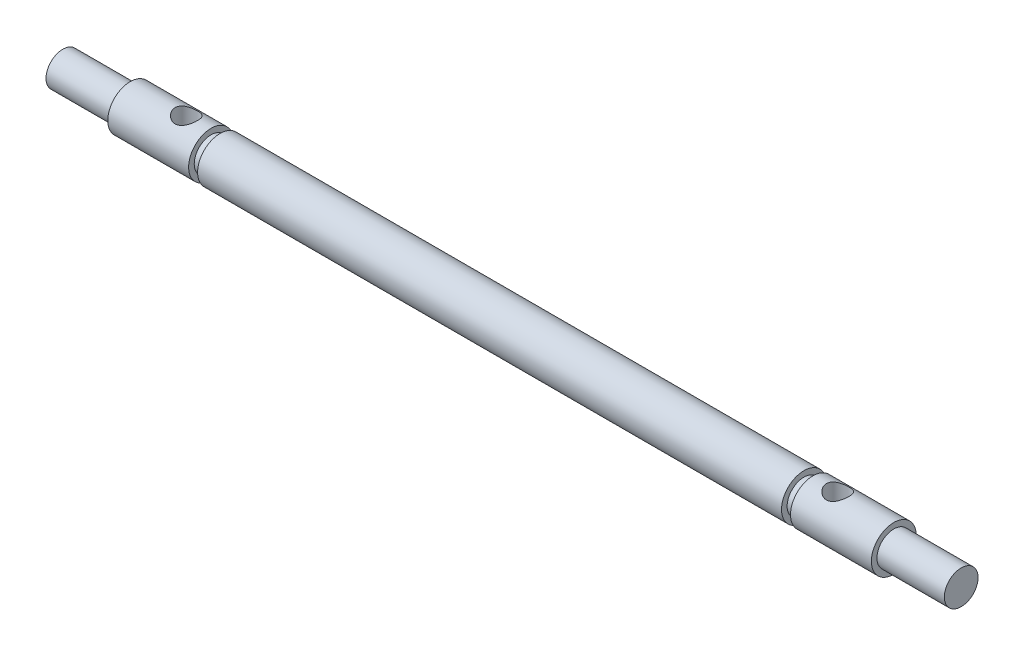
ISO-10303-21;
HEADER;
FILE_DESCRIPTION(('STEP AP214'),'2;1');
FILE_NAME('part.step','',(''),(''),'','','');
FILE_SCHEMA(('AUTOMOTIVE_DESIGN { 1 0 10303 214 1 1 1 1 }'));
ENDSEC;
DATA;
#1=APPLICATION_CONTEXT('core data for automotive mechanical design processes');
#2=APPLICATION_PROTOCOL_DEFINITION('international standard','automotive_design',2000,#1);
#3=PRODUCT_CONTEXT('',#1,'mechanical');
#4=PRODUCT('Part','Part','',(#3));
#5=PRODUCT_RELATED_PRODUCT_CATEGORY('part','',(#4));
#6=PRODUCT_DEFINITION_FORMATION('','',#4);
#7=PRODUCT_DEFINITION_CONTEXT('part definition',#1,'design');
#8=PRODUCT_DEFINITION('design','',#6,#7);
#9=PRODUCT_DEFINITION_SHAPE('','',#8);
#10=(LENGTH_UNIT() NAMED_UNIT(*) SI_UNIT(.MILLI.,.METRE.));
#11=(NAMED_UNIT(*) PLANE_ANGLE_UNIT() SI_UNIT($,.RADIAN.));
#12=(NAMED_UNIT(*) SI_UNIT($,.STERADIAN.) SOLID_ANGLE_UNIT());
#13=UNCERTAINTY_MEASURE_WITH_UNIT(LENGTH_MEASURE(1.E-05),#10,'distance_accuracy_value','');
#14=(GEOMETRIC_REPRESENTATION_CONTEXT(3) GLOBAL_UNCERTAINTY_ASSIGNED_CONTEXT((#13)) GLOBAL_UNIT_ASSIGNED_CONTEXT((#10,
#11,#12)) REPRESENTATION_CONTEXT('',''));
#15=CARTESIAN_POINT('',(0.,0.,0.));
#16=DIRECTION('',(0.,0.,1.));
#17=DIRECTION('',(1.,0.,0.));
#18=AXIS2_PLACEMENT_3D('',#15,#16,#17);
#19=CARTESIAN_POINT('',(0.,0.,0.));
#20=DIRECTION('',(1.,0.,0.));
#21=DIRECTION('',(0.,0.,1.));
#22=AXIS2_PLACEMENT_3D('',#19,#20,#21);
#23=CYLINDRICAL_SURFACE('',#22,2.);
#24=CARTESIAN_POINT('',(-26.8,0.,0.));
#25=DIRECTION('',(-1.,0.,0.));
#26=DIRECTION('',(0.,0.,1.));
#27=AXIS2_PLACEMENT_3D('',#24,#25,#26);
#28=CIRCLE('',#27,2.);
#29=CARTESIAN_POINT('',(-26.8,0.,2.));
#30=VERTEX_POINT('',#29);
#31=EDGE_CURVE('E93',#30,#30,#28,.T.);
#32=ORIENTED_EDGE('',*,*,#31,.T.);
#33=EDGE_LOOP('',(#32));
#34=FACE_BOUND('',#33,.T.);
#35=CARTESIAN_POINT('',(-34.,0.,0.));
#36=DIRECTION('',(-1.,0.,0.));
#37=DIRECTION('',(0.,0.,1.));
#38=AXIS2_PLACEMENT_3D('',#35,#36,#37);
#39=CIRCLE('',#38,2.);
#40=CARTESIAN_POINT('',(-34.,0.,2.));
#41=VERTEX_POINT('',#40);
#42=EDGE_CURVE('E97',#41,#41,#39,.T.);
#43=ORIENTED_EDGE('',*,*,#42,.F.);
#44=EDGE_LOOP('',(#43));
#45=FACE_BOUND('',#44,.T.);
#46=CARTESIAN_POINT('',(-29.,1.73205080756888,0.999999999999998));
#47=CARTESIAN_POINT('',(-28.9478921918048,1.73205534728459,0.999996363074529));
#48=CARTESIAN_POINT('',(-28.895718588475,1.73443801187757,0.995899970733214));
#49=CARTESIAN_POINT('',(-28.7929727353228,1.74362366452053,0.979723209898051));
#50=CARTESIAN_POINT('',(-28.7424040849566,1.7504359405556,0.967626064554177));
#51=CARTESIAN_POINT('',(-28.6445483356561,1.76749346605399,0.93609994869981));
#52=CARTESIAN_POINT('',(-28.5972453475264,1.77772043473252,0.916709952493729));
#53=CARTESIAN_POINT('',(-28.5065757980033,1.80042664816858,0.87126752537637));
#54=CARTESIAN_POINT('',(-28.4632094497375,1.81290601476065,0.845214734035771));
#55=CARTESIAN_POINT('',(-28.3776942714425,1.83996869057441,0.784666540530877));
#56=CARTESIAN_POINT('',(-28.3359408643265,1.85464063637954,0.749652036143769));
#57=CARTESIAN_POINT('',(-28.2585916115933,1.88371982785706,0.673253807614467));
#58=CARTESIAN_POINT('',(-28.2229988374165,1.8981269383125,0.631866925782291));
#59=CARTESIAN_POINT('',(-28.1566328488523,1.92621476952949,0.540489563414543));
#60=CARTESIAN_POINT('',(-28.1263462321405,1.93978106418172,0.490107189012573));
#61=CARTESIAN_POINT('',(-28.0748591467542,1.96350756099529,0.384157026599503));
#62=CARTESIAN_POINT('',(-28.0536529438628,1.97366991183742,0.328592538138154));
#63=CARTESIAN_POINT('',(-28.0224953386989,1.98880461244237,0.218044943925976));
#64=CARTESIAN_POINT('',(-28.0118504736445,1.99409480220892,0.163301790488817));
#65=CARTESIAN_POINT('',(-27.999833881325,2.00007583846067,0.0525706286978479));
#66=CARTESIAN_POINT('',(-27.9984565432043,2.0007694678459,-0.00341660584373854));
#67=CARTESIAN_POINT('',(-28.0047466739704,1.9976298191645,-0.10983252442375));
#68=CARTESIAN_POINT('',(-28.0116380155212,1.9941849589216,-0.160321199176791));
#69=CARTESIAN_POINT('',(-28.0328808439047,1.98374245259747,-0.259313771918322));
#70=CARTESIAN_POINT('',(-28.0472328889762,1.97674454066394,-0.307817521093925));
#71=CARTESIAN_POINT('',(-28.0830825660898,1.95971583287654,-0.402309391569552));
#72=CARTESIAN_POINT('',(-28.1046763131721,1.94964441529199,-0.448253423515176));
#73=CARTESIAN_POINT('',(-28.1542634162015,1.92737645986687,-0.535976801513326));
#74=CARTESIAN_POINT('',(-28.1822590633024,1.91517916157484,-0.577754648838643));
#75=CARTESIAN_POINT('',(-28.246895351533,1.88844394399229,-0.660173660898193));
#76=CARTESIAN_POINT('',(-28.284103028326,1.87379375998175,-0.700334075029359));
#77=CARTESIAN_POINT('',(-28.3645897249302,1.84454340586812,-0.774104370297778));
#78=CARTESIAN_POINT('',(-28.4078733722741,1.82994328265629,-0.807709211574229));
#79=CARTESIAN_POINT('',(-28.5026481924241,1.80144156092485,-0.86950533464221));
#80=CARTESIAN_POINT('',(-28.5544860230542,1.78764319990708,-0.89721731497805));
#81=CARTESIAN_POINT('',(-28.662937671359,1.76375450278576,-0.94331911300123));
#82=CARTESIAN_POINT('',(-28.7195464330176,1.75366030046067,-0.961718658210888));
#83=CARTESIAN_POINT('',(-28.8312145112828,1.73944635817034,-0.987180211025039));
#84=CARTESIAN_POINT('',(-28.8860411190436,1.73491655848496,-0.995025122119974));
#85=CARTESIAN_POINT('',(-28.9964013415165,1.7311791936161,-1.00151694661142));
#86=CARTESIAN_POINT('',(-29.0519344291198,1.73196786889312,-1.00017035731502));
#87=CARTESIAN_POINT('',(-29.1556539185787,1.73834336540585,-0.989036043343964));
#88=CARTESIAN_POINT('',(-29.2039794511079,1.74339587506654,-0.980187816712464));
#89=CARTESIAN_POINT('',(-29.298367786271,1.75694021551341,-0.955696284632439));
#90=CARTESIAN_POINT('',(-29.3444298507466,1.76543316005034,-0.940050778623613));
#91=CARTESIAN_POINT('',(-29.4354113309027,1.78536222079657,-0.901647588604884));
#92=CARTESIAN_POINT('',(-29.4801790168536,1.79691643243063,-0.87859406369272));
#93=CARTESIAN_POINT('',(-29.565469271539,1.8215611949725,-0.826287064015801));
#94=CARTESIAN_POINT('',(-29.6059896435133,1.83465253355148,-0.797030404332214));
#95=CARTESIAN_POINT('',(-29.6869787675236,1.86287998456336,-0.728837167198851));
#96=CARTESIAN_POINT('',(-29.7267971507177,1.87806583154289,-0.689145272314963));
#97=CARTESIAN_POINT('',(-29.7994122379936,1.90734234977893,-0.603404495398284));
#98=CARTESIAN_POINT('',(-29.8322065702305,1.92143265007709,-0.557353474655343));
#99=CARTESIAN_POINT('',(-29.8905737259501,1.94741361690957,-0.458535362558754));
#100=CARTESIAN_POINT('',(-29.9159331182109,1.95923641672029,-0.40562309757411));
#101=CARTESIAN_POINT('',(-29.9571379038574,1.97883354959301,-0.29552236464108));
#102=CARTESIAN_POINT('',(-29.9729916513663,1.98661143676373,-0.238337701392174));
#103=CARTESIAN_POINT('',(-29.9933685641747,1.99667508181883,-0.126979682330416));
#104=CARTESIAN_POINT('',(-29.9987978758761,1.99939927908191,-0.0730114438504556));
#105=CARTESIAN_POINT('',(-30.0008432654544,2.00042130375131,0.0351259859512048));
#106=CARTESIAN_POINT('',(-29.9974624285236,1.9987206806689,0.0892951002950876));
#107=CARTESIAN_POINT('',(-29.9825835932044,1.99133968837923,0.192537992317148));
#108=CARTESIAN_POINT('',(-29.9716351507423,1.9859289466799,0.241712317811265));
#109=CARTESIAN_POINT('',(-29.942673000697,1.97192093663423,0.337445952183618));
#110=CARTESIAN_POINT('',(-29.9246582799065,1.96332321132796,0.384004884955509));
#111=CARTESIAN_POINT('',(-29.881272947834,1.9432593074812,0.475423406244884));
#112=CARTESIAN_POINT('',(-29.8556206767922,1.93168617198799,0.520125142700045));
#113=CARTESIAN_POINT('',(-29.798042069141,1.90688133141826,0.604774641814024));
#114=CARTESIAN_POINT('',(-29.7661128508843,1.89364886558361,0.644720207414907));
#115=CARTESIAN_POINT('',(-29.6932028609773,1.86528610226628,0.72291400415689));
#116=CARTESIAN_POINT('',(-29.6516375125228,1.85009799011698,0.760597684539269));
#117=CARTESIAN_POINT('',(-29.5625492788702,1.82063076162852,0.828663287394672));
#118=CARTESIAN_POINT('',(-29.5150211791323,1.80635245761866,0.859038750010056));
#119=CARTESIAN_POINT('',(-29.413363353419,1.77999605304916,0.912431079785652));
#120=CARTESIAN_POINT('',(-29.3590724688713,1.7680017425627,0.935185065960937));
#121=CARTESIAN_POINT('',(-29.2466675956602,1.74866156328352,0.970878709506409));
#122=CARTESIAN_POINT('',(-29.1885671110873,1.74130016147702,0.983851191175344));
#123=CARTESIAN_POINT('',(-29.108194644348,1.73529272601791,0.994367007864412));
#124=CARTESIAN_POINT('',(-29.0866321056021,1.73408129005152,0.996476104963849));
#125=CARTESIAN_POINT('',(-29.0433835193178,1.7324593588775,0.999293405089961));
#126=CARTESIAN_POINT('',(-29.0216974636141,1.73204891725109,1.00000151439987));
#127=CARTESIAN_POINT('',(-29.,1.73205080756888,0.999999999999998));
#128=B_SPLINE_CURVE_WITH_KNOTS('',3,(#46,#47,#48,#49,#50,#51,#52,#53,#54,#55,#56,#57,#58,#59,
#60,#61,#62,#63,#64,#65,#66,#67,#68,#69,#70,#71,#72,#73,#74,#75,#76,#77,#78,#79,#80,#81,#82,#83,
#84,#85,#86,#87,#88,#89,#90,#91,#92,#93,#94,#95,#96,#97,#98,#99,#100,#101,#102,#103,#104,#105,
#106,#107,#108,#109,#110,#111,#112,#113,#114,#115,#116,#117,#118,#119,#120,#121,#122,#123,#124,
#125,#126,#127),.UNSPECIFIED.,.T.,.F.,(4,2,2,2,2,2,2,2,2,2,2,2,2,2,2,2,2,2,2,2,2,2,2,2,2,2,2,2,
2,2,2,2,2,2,2,2,2,2,2,2,4),(0.,0.156232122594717,0.312792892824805,0.468528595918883,
0.624272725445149,0.79286231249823,0.96153571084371,1.14157892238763,1.32150826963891,
1.48863484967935,1.6556602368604,1.80816097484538,1.96067312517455,2.11529534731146,
2.26997299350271,2.4392719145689,2.60870048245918,2.78888841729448,2.96888774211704,
3.13462290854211,3.30024093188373,3.44774183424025,3.59529052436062,3.74967296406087,
3.90413486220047,4.07806743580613,4.25205864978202,4.43064181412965,4.60906779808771,
4.77112270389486,4.93312086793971,5.08444424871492,5.23578933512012,5.39360750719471,
5.55149830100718,5.72510241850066,5.89885942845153,6.07810749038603,6.25675133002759,
6.32180135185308,6.38685572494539),.UNSPECIFIED.);
#129=CARTESIAN_POINT('',(-29.,1.73205080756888,0.999999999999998));
#130=VERTEX_POINT('',#129);
#131=EDGE_CURVE('E40',#130,#130,#128,.T.);
#132=ORIENTED_EDGE('',*,*,#131,.F.);
#133=EDGE_LOOP('',(#132));
#134=FACE_BOUND('',#133,.T.);
#135=CARTESIAN_POINT('',(-28.,-2.,0.));
#136=CARTESIAN_POINT('',(-28.0000033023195,-1.99999713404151,0.0525719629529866));
#137=CARTESIAN_POINT('',(-28.0041700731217,-1.99790491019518,0.105206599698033));
#138=CARTESIAN_POINT('',(-28.0206528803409,-1.98974156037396,0.208920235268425));
#139=CARTESIAN_POINT('',(-28.0329843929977,-1.98366287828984,0.259996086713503));
#140=CARTESIAN_POINT('',(-28.0651938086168,-1.96816279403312,0.358933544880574));
#141=CARTESIAN_POINT('',(-28.085042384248,-1.9587543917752,0.406806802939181));
#142=CARTESIAN_POINT('',(-28.1315706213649,-1.93745776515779,0.498472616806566));
#143=CARTESIAN_POINT('',(-28.1582497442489,-1.9255697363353,0.542265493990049));
#144=CARTESIAN_POINT('',(-28.2195172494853,-1.89956258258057,0.627507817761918));
#145=CARTESIAN_POINT('',(-28.2544864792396,-1.88535199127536,0.668655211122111));
#146=CARTESIAN_POINT('',(-28.330521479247,-1.85659970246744,0.744779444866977));
#147=CARTESIAN_POINT('',(-28.3715918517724,-1.84205776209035,0.779751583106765));
#148=CARTESIAN_POINT('',(-28.4624833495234,-1.81298951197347,0.845252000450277));
#149=CARTESIAN_POINT('',(-28.5127360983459,-1.79855186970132,0.875225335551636));
#150=CARTESIAN_POINT('',(-28.6183673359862,-1.77285978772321,0.926168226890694));
#151=CARTESIAN_POINT('',(-28.6737421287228,-1.7616030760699,0.947144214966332));
#152=CARTESIAN_POINT('',(-28.7846651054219,-1.74457867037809,0.978132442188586));
#153=CARTESIAN_POINT('',(-28.8400044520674,-1.73852271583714,0.988725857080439));
#154=CARTESIAN_POINT('',(-28.9519788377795,-1.73181889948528,1.00042699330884));
#155=CARTESIAN_POINT('',(-29.0086125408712,-1.73116569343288,1.00154408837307));
#156=CARTESIAN_POINT('',(-29.1142860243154,-1.73510930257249,0.994687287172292));
#157=CARTESIAN_POINT('',(-29.163424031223,-1.73908763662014,0.98778455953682));
#158=CARTESIAN_POINT('',(-29.259721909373,-1.7507622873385,0.966939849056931));
#159=CARTESIAN_POINT('',(-29.3068811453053,-1.75845978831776,0.95299562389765));
#160=CARTESIAN_POINT('',(-29.3992291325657,-1.77687476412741,0.918209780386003));
#161=CARTESIAN_POINT('',(-29.4443463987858,-1.78765840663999,0.897215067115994));
#162=CARTESIAN_POINT('',(-29.53063429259,-1.81103404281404,0.849041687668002));
#163=CARTESIAN_POINT('',(-29.5718031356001,-1.82362684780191,0.821860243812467));
#164=CARTESIAN_POINT('',(-29.6545212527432,-1.85113157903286,0.758066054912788));
#165=CARTESIAN_POINT('',(-29.6954568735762,-1.86613510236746,0.720694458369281));
#166=CARTESIAN_POINT('',(-29.7707354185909,-1.89547623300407,0.639555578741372));
#167=CARTESIAN_POINT('',(-29.8050751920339,-1.90981351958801,0.595785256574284));
#168=CARTESIAN_POINT('',(-29.8676856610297,-1.93701987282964,0.500516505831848));
#169=CARTESIAN_POINT('',(-29.8956004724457,-1.94978984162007,0.448753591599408));
#170=CARTESIAN_POINT('',(-29.942097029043,-1.97157881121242,0.340466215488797));
#171=CARTESIAN_POINT('',(-29.9606861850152,-1.98060078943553,0.283945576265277));
#172=CARTESIAN_POINT('',(-29.9864754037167,-1.99324333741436,0.172766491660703));
#173=CARTESIAN_POINT('',(-29.9944912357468,-1.99724938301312,0.118341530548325));
#174=CARTESIAN_POINT('',(-30.0014647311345,-2.00073013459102,0.0087795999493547));
#175=CARTESIAN_POINT('',(-30.0004266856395,-2.00020698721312,-0.0463570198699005));
#176=CARTESIAN_POINT('',(-29.9897933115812,-1.99491192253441,-0.151232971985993));
#177=CARTESIAN_POINT('',(-29.98086746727,-1.9904724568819,-0.201059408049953));
#178=CARTESIAN_POINT('',(-29.9557619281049,-1.97822171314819,-0.298406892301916));
#179=CARTESIAN_POINT('',(-29.9395814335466,-1.97041006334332,-0.345927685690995));
#180=CARTESIAN_POINT('',(-29.9000015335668,-1.95184251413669,-0.438888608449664));
#181=CARTESIAN_POINT('',(-29.8764089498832,-1.94100881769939,-0.484230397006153));
#182=CARTESIAN_POINT('',(-29.822892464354,-1.91743974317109,-0.57046136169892));
#183=CARTESIAN_POINT('',(-29.7929658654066,-1.90470355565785,-0.61134862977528));
#184=CARTESIAN_POINT('',(-29.7242395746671,-1.87708221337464,-0.691767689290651));
#185=CARTESIAN_POINT('',(-29.6848571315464,-1.86210884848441,-0.730772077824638));
#186=CARTESIAN_POINT('',(-29.6000748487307,-1.83262391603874,-0.801856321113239));
#187=CARTESIAN_POINT('',(-29.5546708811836,-1.81811267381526,-0.83393138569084));
#188=CARTESIAN_POINT('',(-29.4563563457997,-1.79051192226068,-0.891707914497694));
#189=CARTESIAN_POINT('',(-29.4031887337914,-1.77752529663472,-0.917025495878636));
#190=CARTESIAN_POINT('',(-29.2924899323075,-1.75574072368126,-0.958082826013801));
#191=CARTESIAN_POINT('',(-29.2349644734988,-1.74693738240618,-0.973834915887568));
#192=CARTESIAN_POINT('',(-29.1230897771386,-1.73561501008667,-0.993861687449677));
#193=CARTESIAN_POINT('',(-29.068965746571,-1.73257383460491,-0.999092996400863));
#194=CARTESIAN_POINT('',(-28.9605529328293,-1.73165354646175,-1.00068915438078));
#195=CARTESIAN_POINT('',(-28.9062642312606,-1.73377219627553,-0.997057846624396));
#196=CARTESIAN_POINT('',(-28.804516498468,-1.74237862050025,-0.981926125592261));
#197=CARTESIAN_POINT('',(-28.7568995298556,-1.74843094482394,-0.971208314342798));
#198=CARTESIAN_POINT('',(-28.6641918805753,-1.76371016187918,-0.943175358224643));
#199=CARTESIAN_POINT('',(-28.619102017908,-1.77293807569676,-0.925858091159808));
#200=CARTESIAN_POINT('',(-28.5293751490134,-1.79428530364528,-0.88381574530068));
#201=CARTESIAN_POINT('',(-28.4849720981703,-1.80655722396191,-0.858671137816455));
#202=CARTESIAN_POINT('',(-28.4007254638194,-1.8323533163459,-0.802150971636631));
#203=CARTESIAN_POINT('',(-28.3608842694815,-1.84587813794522,-0.770772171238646));
#204=CARTESIAN_POINT('',(-28.2818580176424,-1.87462323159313,-0.69820332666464));
#205=CARTESIAN_POINT('',(-28.2433408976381,-1.88984983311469,-0.65628442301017));
#206=CARTESIAN_POINT('',(-28.1737370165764,-1.91877752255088,-0.566154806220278));
#207=CARTESIAN_POINT('',(-28.1426542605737,-1.9324777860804,-0.517940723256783));
#208=CARTESIAN_POINT('',(-28.0887636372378,-1.95698009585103,-0.415931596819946));
#209=CARTESIAN_POINT('',(-28.0660158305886,-1.96776096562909,-0.362099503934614));
#210=CARTESIAN_POINT('',(-28.030191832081,-1.98501341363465,-0.250742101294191));
#211=CARTESIAN_POINT('',(-28.0170881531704,-1.99149723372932,-0.193227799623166));
#212=CARTESIAN_POINT('',(-28.0061025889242,-1.99695461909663,-0.112601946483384));
#213=CARTESIAN_POINT('',(-28.0038173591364,-1.99809365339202,-0.0901618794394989));
#214=CARTESIAN_POINT('',(-28.0007653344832,-1.99961696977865,-0.0451517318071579));
#215=CARTESIAN_POINT('',(-27.9999985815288,-2.00000123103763,-0.0225816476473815));
#216=CARTESIAN_POINT('',(-28.,-2.,0.));
#217=B_SPLINE_CURVE_WITH_KNOTS('',3,(#135,#136,#137,#138,#139,#140,#141,#142,#143,#144,#145,
#146,#147,#148,#149,#150,#151,#152,#153,#154,#155,#156,#157,#158,#159,#160,#161,#162,#163,#164,
#165,#166,#167,#168,#169,#170,#171,#172,#173,#174,#175,#176,#177,#178,#179,#180,#181,#182,#183,
#184,#185,#186,#187,#188,#189,#190,#191,#192,#193,#194,#195,#196,#197,#198,#199,#200,#201,#202,
#203,#204,#205,#206,#207,#208,#209,#210,#211,#212,#213,#214,#215,#216),.UNSPECIFIED.,.T.,.F.,(4,
2,2,2,2,2,2,2,2,2,2,2,2,2,2,2,2,2,2,2,2,2,2,2,2,2,2,2,2,2,2,2,2,2,2,2,2,2,2,2,4),(0.,
0.157624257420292,0.315548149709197,0.472862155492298,0.630163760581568,0.796981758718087,
0.963926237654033,1.14381726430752,1.32357947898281,1.49258012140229,1.6614135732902,
1.8100571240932,1.95874803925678,2.11090240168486,2.26312521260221,2.43464941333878,
2.60625534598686,2.7858302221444,2.96526216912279,3.12983290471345,3.29432564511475,
3.44606906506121,3.59782921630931,3.75392856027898,3.91009450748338,4.08159610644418,
4.25321588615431,4.43314682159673,4.61284511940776,4.77529307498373,4.93767059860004,
5.08457930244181,5.23153528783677,5.38836456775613,5.54527561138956,5.72125242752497,
5.89732383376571,6.07464013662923,6.25144908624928,6.31915280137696,6.38685838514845),.UNSPECIFIED.);
#218=CARTESIAN_POINT('',(-28.,-2.,0.));
#219=VERTEX_POINT('',#218);
#220=EDGE_CURVE('E10',#219,#219,#217,.T.);
#221=ORIENTED_EDGE('',*,*,#220,.F.);
#222=EDGE_LOOP('',(#221));
#223=FACE_BOUND('',#222,.T.);
#224=ADVANCED_FACE('F29',(#34,#45,#134,#223),#23,.T.);
#225=CARTESIAN_POINT('',(40.,0.,-1.5));
#226=DIRECTION('',(-1.,0.,0.));
#227=DIRECTION('',(0.,0.,1.));
#228=AXIS2_PLACEMENT_3D('',#225,#226,#227);
#229=PLANE('',#228);
#230=CARTESIAN_POINT('',(40.,0.,0.));
#231=DIRECTION('',(-1.,0.,0.));
#232=DIRECTION('',(0.,0.,1.));
#233=AXIS2_PLACEMENT_3D('',#230,#231,#232);
#234=CIRCLE('',#233,1.5);
#235=CARTESIAN_POINT('',(40.,0.,1.5));
#236=VERTEX_POINT('',#235);
#237=EDGE_CURVE('E128',#236,#236,#234,.T.);
#238=ORIENTED_EDGE('',*,*,#237,.F.);
#239=EDGE_LOOP('',(#238));
#240=FACE_BOUND('',#239,.T.);
#241=ADVANCED_FACE('F31',(#240),#229,.F.);
#242=CARTESIAN_POINT('',(0.,0.,0.));
#243=DIRECTION('',(-1.,0.,0.));
#244=DIRECTION('',(0.,0.,1.));
#245=AXIS2_PLACEMENT_3D('',#242,#243,#244);
#246=CYLINDRICAL_SURFACE('',#245,1.5);
#247=CARTESIAN_POINT('',(34.,0.,0.));
#248=DIRECTION('',(-1.,0.,0.));
#249=DIRECTION('',(0.,0.,1.));
#250=AXIS2_PLACEMENT_3D('',#247,#248,#249);
#251=CIRCLE('',#250,1.5);
#252=CARTESIAN_POINT('',(34.,0.,1.5));
#253=VERTEX_POINT('',#252);
#254=EDGE_CURVE('E125',#253,#253,#251,.T.);
#255=ORIENTED_EDGE('',*,*,#254,.F.);
#256=EDGE_LOOP('',(#255));
#257=FACE_BOUND('',#256,.T.);
#258=ORIENTED_EDGE('',*,*,#237,.T.);
#259=EDGE_LOOP('',(#258));
#260=FACE_BOUND('',#259,.T.);
#261=ADVANCED_FACE('F88',(#257,#260),#246,.T.);
#262=CARTESIAN_POINT('',(34.,0.,-2.));
#263=DIRECTION('',(-1.,0.,0.));
#264=DIRECTION('',(0.,0.,1.));
#265=AXIS2_PLACEMENT_3D('',#262,#263,#264);
#266=PLANE('',#265);
#267=CARTESIAN_POINT('',(34.,0.,0.));
#268=DIRECTION('',(-1.,0.,0.));
#269=DIRECTION('',(0.,0.,1.));
#270=AXIS2_PLACEMENT_3D('',#267,#268,#269);
#271=CIRCLE('',#270,2.);
#272=CARTESIAN_POINT('',(34.,0.,2.));
#273=VERTEX_POINT('',#272);
#274=EDGE_CURVE('E122',#273,#273,#271,.T.);
#275=ORIENTED_EDGE('',*,*,#274,.F.);
#276=EDGE_LOOP('',(#275));
#277=FACE_BOUND('',#276,.T.);
#278=ORIENTED_EDGE('',*,*,#254,.T.);
#279=EDGE_LOOP('',(#278));
#280=FACE_BOUND('',#279,.T.);
#281=ADVANCED_FACE('F163',(#277,#280),#266,.F.);
#282=CARTESIAN_POINT('',(0.,0.,0.));
#283=DIRECTION('',(-1.,0.,0.));
#284=DIRECTION('',(0.,0.,1.));
#285=AXIS2_PLACEMENT_3D('',#282,#283,#284);
#286=CYLINDRICAL_SURFACE('',#285,2.);
#287=CARTESIAN_POINT('',(28.,-2.,0.));
#288=CARTESIAN_POINT('',(28.0000033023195,-1.99999713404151,0.0525719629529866));
#289=CARTESIAN_POINT('',(28.0041700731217,-1.99790491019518,0.105206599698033));
#290=CARTESIAN_POINT('',(28.0206528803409,-1.98974156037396,0.208920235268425));
#291=CARTESIAN_POINT('',(28.0329843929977,-1.98366287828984,0.259996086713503));
#292=CARTESIAN_POINT('',(28.0651938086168,-1.96816279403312,0.358933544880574));
#293=CARTESIAN_POINT('',(28.085042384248,-1.9587543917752,0.406806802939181));
#294=CARTESIAN_POINT('',(28.1315706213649,-1.93745776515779,0.498472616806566));
#295=CARTESIAN_POINT('',(28.1582497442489,-1.9255697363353,0.542265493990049));
#296=CARTESIAN_POINT('',(28.2195172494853,-1.89956258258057,0.627507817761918));
#297=CARTESIAN_POINT('',(28.2544864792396,-1.88535199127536,0.668655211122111));
#298=CARTESIAN_POINT('',(28.330521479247,-1.85659970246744,0.744779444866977));
#299=CARTESIAN_POINT('',(28.3715918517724,-1.84205776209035,0.779751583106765));
#300=CARTESIAN_POINT('',(28.4624833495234,-1.81298951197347,0.845252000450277));
#301=CARTESIAN_POINT('',(28.5127360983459,-1.79855186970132,0.875225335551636));
#302=CARTESIAN_POINT('',(28.6183673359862,-1.77285978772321,0.926168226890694));
#303=CARTESIAN_POINT('',(28.6737421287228,-1.7616030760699,0.947144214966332));
#304=CARTESIAN_POINT('',(28.7846651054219,-1.74457867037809,0.978132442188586));
#305=CARTESIAN_POINT('',(28.8400044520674,-1.73852271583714,0.988725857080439));
#306=CARTESIAN_POINT('',(28.9519788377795,-1.73181889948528,1.00042699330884));
#307=CARTESIAN_POINT('',(29.0086125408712,-1.73116569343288,1.00154408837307));
#308=CARTESIAN_POINT('',(29.1142860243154,-1.73510930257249,0.994687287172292));
#309=CARTESIAN_POINT('',(29.163424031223,-1.73908763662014,0.98778455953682));
#310=CARTESIAN_POINT('',(29.259721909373,-1.7507622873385,0.966939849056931));
#311=CARTESIAN_POINT('',(29.3068811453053,-1.75845978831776,0.95299562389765));
#312=CARTESIAN_POINT('',(29.3992291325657,-1.77687476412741,0.918209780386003));
#313=CARTESIAN_POINT('',(29.4443463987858,-1.78765840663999,0.897215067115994));
#314=CARTESIAN_POINT('',(29.53063429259,-1.81103404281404,0.849041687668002));
#315=CARTESIAN_POINT('',(29.5718031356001,-1.82362684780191,0.821860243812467));
#316=CARTESIAN_POINT('',(29.6545212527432,-1.85113157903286,0.758066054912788));
#317=CARTESIAN_POINT('',(29.6954568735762,-1.86613510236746,0.720694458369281));
#318=CARTESIAN_POINT('',(29.7707354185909,-1.89547623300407,0.639555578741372));
#319=CARTESIAN_POINT('',(29.8050751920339,-1.90981351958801,0.595785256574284));
#320=CARTESIAN_POINT('',(29.8676856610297,-1.93701987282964,0.500516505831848));
#321=CARTESIAN_POINT('',(29.8956004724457,-1.94978984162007,0.448753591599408));
#322=CARTESIAN_POINT('',(29.942097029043,-1.97157881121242,0.340466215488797));
#323=CARTESIAN_POINT('',(29.9606861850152,-1.98060078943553,0.283945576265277));
#324=CARTESIAN_POINT('',(29.9864754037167,-1.99324333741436,0.172766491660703));
#325=CARTESIAN_POINT('',(29.9944912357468,-1.99724938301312,0.118341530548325));
#326=CARTESIAN_POINT('',(30.0014647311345,-2.00073013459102,0.0087795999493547));
#327=CARTESIAN_POINT('',(30.0004266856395,-2.00020698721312,-0.0463570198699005));
#328=CARTESIAN_POINT('',(29.9897933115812,-1.99491192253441,-0.151232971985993));
#329=CARTESIAN_POINT('',(29.98086746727,-1.9904724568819,-0.201059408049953));
#330=CARTESIAN_POINT('',(29.9557619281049,-1.97822171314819,-0.298406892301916));
#331=CARTESIAN_POINT('',(29.9395814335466,-1.97041006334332,-0.345927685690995));
#332=CARTESIAN_POINT('',(29.9000015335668,-1.95184251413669,-0.438888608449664));
#333=CARTESIAN_POINT('',(29.8764089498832,-1.94100881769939,-0.484230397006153));
#334=CARTESIAN_POINT('',(29.822892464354,-1.91743974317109,-0.57046136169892));
#335=CARTESIAN_POINT('',(29.7929658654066,-1.90470355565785,-0.61134862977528));
#336=CARTESIAN_POINT('',(29.7242395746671,-1.87708221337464,-0.691767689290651));
#337=CARTESIAN_POINT('',(29.6848571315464,-1.86210884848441,-0.730772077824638));
#338=CARTESIAN_POINT('',(29.6000748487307,-1.83262391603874,-0.801856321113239));
#339=CARTESIAN_POINT('',(29.5546708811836,-1.81811267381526,-0.83393138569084));
#340=CARTESIAN_POINT('',(29.4563563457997,-1.79051192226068,-0.891707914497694));
#341=CARTESIAN_POINT('',(29.4031887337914,-1.77752529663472,-0.917025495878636));
#342=CARTESIAN_POINT('',(29.2924899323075,-1.75574072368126,-0.958082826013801));
#343=CARTESIAN_POINT('',(29.2349644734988,-1.74693738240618,-0.973834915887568));
#344=CARTESIAN_POINT('',(29.1230897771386,-1.73561501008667,-0.993861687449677));
#345=CARTESIAN_POINT('',(29.068965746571,-1.73257383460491,-0.999092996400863));
#346=CARTESIAN_POINT('',(28.9605529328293,-1.73165354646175,-1.00068915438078));
#347=CARTESIAN_POINT('',(28.9062642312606,-1.73377219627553,-0.997057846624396));
#348=CARTESIAN_POINT('',(28.804516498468,-1.74237862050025,-0.981926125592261));
#349=CARTESIAN_POINT('',(28.7568995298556,-1.74843094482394,-0.971208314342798));
#350=CARTESIAN_POINT('',(28.6641918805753,-1.76371016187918,-0.943175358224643));
#351=CARTESIAN_POINT('',(28.619102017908,-1.77293807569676,-0.925858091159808));
#352=CARTESIAN_POINT('',(28.5293751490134,-1.79428530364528,-0.88381574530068));
#353=CARTESIAN_POINT('',(28.4849720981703,-1.80655722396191,-0.858671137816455));
#354=CARTESIAN_POINT('',(28.4007254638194,-1.8323533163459,-0.802150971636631));
#355=CARTESIAN_POINT('',(28.3608842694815,-1.84587813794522,-0.770772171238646));
#356=CARTESIAN_POINT('',(28.2818580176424,-1.87462323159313,-0.69820332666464));
#357=CARTESIAN_POINT('',(28.2433408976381,-1.88984983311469,-0.65628442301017));
#358=CARTESIAN_POINT('',(28.1737370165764,-1.91877752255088,-0.566154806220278));
#359=CARTESIAN_POINT('',(28.1426542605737,-1.9324777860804,-0.517940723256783));
#360=CARTESIAN_POINT('',(28.0887636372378,-1.95698009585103,-0.415931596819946));
#361=CARTESIAN_POINT('',(28.0660158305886,-1.96776096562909,-0.362099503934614));
#362=CARTESIAN_POINT('',(28.030191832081,-1.98501341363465,-0.250742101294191));
#363=CARTESIAN_POINT('',(28.0170881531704,-1.99149723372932,-0.193227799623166));
#364=CARTESIAN_POINT('',(28.0061025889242,-1.99695461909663,-0.112601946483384));
#365=CARTESIAN_POINT('',(28.0038173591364,-1.99809365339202,-0.0901618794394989));
#366=CARTESIAN_POINT('',(28.0007653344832,-1.99961696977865,-0.0451517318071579));
#367=CARTESIAN_POINT('',(27.9999985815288,-2.00000123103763,-0.0225816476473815));
#368=CARTESIAN_POINT('',(28.,-2.,0.));
#369=B_SPLINE_CURVE_WITH_KNOTS('',3,(#287,#288,#289,#290,#291,#292,#293,#294,#295,#296,#297,
#298,#299,#300,#301,#302,#303,#304,#305,#306,#307,#308,#309,#310,#311,#312,#313,#314,#315,#316,
#317,#318,#319,#320,#321,#322,#323,#324,#325,#326,#327,#328,#329,#330,#331,#332,#333,#334,#335,
#336,#337,#338,#339,#340,#341,#342,#343,#344,#345,#346,#347,#348,#349,#350,#351,#352,#353,#354,
#355,#356,#357,#358,#359,#360,#361,#362,#363,#364,#365,#366,#367,#368),.UNSPECIFIED.,.T.,.F.,(4,
2,2,2,2,2,2,2,2,2,2,2,2,2,2,2,2,2,2,2,2,2,2,2,2,2,2,2,2,2,2,2,2,2,2,2,2,2,2,2,4),(0.,
0.157624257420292,0.315548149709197,0.472862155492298,0.630163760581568,0.796981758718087,
0.963926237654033,1.14381726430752,1.32357947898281,1.49258012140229,1.6614135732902,
1.8100571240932,1.95874803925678,2.11090240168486,2.26312521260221,2.43464941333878,
2.60625534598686,2.7858302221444,2.96526216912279,3.12983290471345,3.29432564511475,
3.44606906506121,3.59782921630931,3.75392856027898,3.91009450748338,4.08159610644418,
4.25321588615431,4.43314682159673,4.61284511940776,4.77529307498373,4.93767059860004,
5.08457930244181,5.23153528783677,5.38836456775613,5.54527561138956,5.72125242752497,
5.89732383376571,6.07464013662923,6.25144908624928,6.31915280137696,6.38685838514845),.UNSPECIFIED.);
#370=CARTESIAN_POINT('',(28.,-2.,0.));
#371=VERTEX_POINT('',#370);
#372=EDGE_CURVE('E44',#371,#371,#369,.T.);
#373=ORIENTED_EDGE('',*,*,#372,.T.);
#374=EDGE_LOOP('',(#373));
#375=FACE_BOUND('',#374,.T.);
#376=CARTESIAN_POINT('',(29.,1.73205080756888,0.999999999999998));
#377=CARTESIAN_POINT('',(28.9478921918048,1.73205534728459,0.999996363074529));
#378=CARTESIAN_POINT('',(28.895718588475,1.73443801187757,0.995899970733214));
#379=CARTESIAN_POINT('',(28.7929727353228,1.74362366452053,0.979723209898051));
#380=CARTESIAN_POINT('',(28.7424040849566,1.7504359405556,0.967626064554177));
#381=CARTESIAN_POINT('',(28.6445483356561,1.76749346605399,0.93609994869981));
#382=CARTESIAN_POINT('',(28.5972453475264,1.77772043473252,0.916709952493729));
#383=CARTESIAN_POINT('',(28.5065757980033,1.80042664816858,0.87126752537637));
#384=CARTESIAN_POINT('',(28.4632094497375,1.81290601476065,0.845214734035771));
#385=CARTESIAN_POINT('',(28.3776942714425,1.83996869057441,0.784666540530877));
#386=CARTESIAN_POINT('',(28.3359408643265,1.85464063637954,0.749652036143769));
#387=CARTESIAN_POINT('',(28.2585916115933,1.88371982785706,0.673253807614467));
#388=CARTESIAN_POINT('',(28.2229988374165,1.8981269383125,0.631866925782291));
#389=CARTESIAN_POINT('',(28.1566328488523,1.92621476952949,0.540489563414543));
#390=CARTESIAN_POINT('',(28.1263462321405,1.93978106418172,0.490107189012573));
#391=CARTESIAN_POINT('',(28.0748591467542,1.96350756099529,0.384157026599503));
#392=CARTESIAN_POINT('',(28.0536529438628,1.97366991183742,0.328592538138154));
#393=CARTESIAN_POINT('',(28.0224953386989,1.98880461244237,0.218044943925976));
#394=CARTESIAN_POINT('',(28.0118504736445,1.99409480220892,0.163301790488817));
#395=CARTESIAN_POINT('',(27.999833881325,2.00007583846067,0.0525706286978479));
#396=CARTESIAN_POINT('',(27.9984565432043,2.0007694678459,-0.00341660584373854));
#397=CARTESIAN_POINT('',(28.0047466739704,1.9976298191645,-0.10983252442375));
#398=CARTESIAN_POINT('',(28.0116380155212,1.9941849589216,-0.160321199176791));
#399=CARTESIAN_POINT('',(28.0328808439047,1.98374245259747,-0.259313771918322));
#400=CARTESIAN_POINT('',(28.0472328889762,1.97674454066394,-0.307817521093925));
#401=CARTESIAN_POINT('',(28.0830825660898,1.95971583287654,-0.402309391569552));
#402=CARTESIAN_POINT('',(28.1046763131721,1.94964441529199,-0.448253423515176));
#403=CARTESIAN_POINT('',(28.1542634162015,1.92737645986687,-0.535976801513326));
#404=CARTESIAN_POINT('',(28.1822590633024,1.91517916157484,-0.577754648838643));
#405=CARTESIAN_POINT('',(28.246895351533,1.88844394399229,-0.660173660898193));
#406=CARTESIAN_POINT('',(28.284103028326,1.87379375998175,-0.700334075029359));
#407=CARTESIAN_POINT('',(28.3645897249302,1.84454340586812,-0.774104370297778));
#408=CARTESIAN_POINT('',(28.4078733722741,1.82994328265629,-0.807709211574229));
#409=CARTESIAN_POINT('',(28.5026481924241,1.80144156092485,-0.86950533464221));
#410=CARTESIAN_POINT('',(28.5544860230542,1.78764319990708,-0.89721731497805));
#411=CARTESIAN_POINT('',(28.662937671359,1.76375450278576,-0.94331911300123));
#412=CARTESIAN_POINT('',(28.7195464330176,1.75366030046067,-0.961718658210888));
#413=CARTESIAN_POINT('',(28.8312145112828,1.73944635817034,-0.987180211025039));
#414=CARTESIAN_POINT('',(28.8860411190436,1.73491655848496,-0.995025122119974));
#415=CARTESIAN_POINT('',(28.9964013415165,1.7311791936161,-1.00151694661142));
#416=CARTESIAN_POINT('',(29.0519344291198,1.73196786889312,-1.00017035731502));
#417=CARTESIAN_POINT('',(29.1556539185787,1.73834336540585,-0.989036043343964));
#418=CARTESIAN_POINT('',(29.2039794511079,1.74339587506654,-0.980187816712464));
#419=CARTESIAN_POINT('',(29.298367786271,1.75694021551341,-0.955696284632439));
#420=CARTESIAN_POINT('',(29.3444298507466,1.76543316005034,-0.940050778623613));
#421=CARTESIAN_POINT('',(29.4354113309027,1.78536222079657,-0.901647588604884));
#422=CARTESIAN_POINT('',(29.4801790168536,1.79691643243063,-0.87859406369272));
#423=CARTESIAN_POINT('',(29.565469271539,1.8215611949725,-0.826287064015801));
#424=CARTESIAN_POINT('',(29.6059896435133,1.83465253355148,-0.797030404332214));
#425=CARTESIAN_POINT('',(29.6869787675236,1.86287998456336,-0.728837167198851));
#426=CARTESIAN_POINT('',(29.7267971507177,1.87806583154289,-0.689145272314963));
#427=CARTESIAN_POINT('',(29.7994122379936,1.90734234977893,-0.603404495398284));
#428=CARTESIAN_POINT('',(29.8322065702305,1.92143265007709,-0.557353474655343));
#429=CARTESIAN_POINT('',(29.8905737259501,1.94741361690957,-0.458535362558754));
#430=CARTESIAN_POINT('',(29.9159331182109,1.95923641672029,-0.40562309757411));
#431=CARTESIAN_POINT('',(29.9571379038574,1.97883354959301,-0.29552236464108));
#432=CARTESIAN_POINT('',(29.9729916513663,1.98661143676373,-0.238337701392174));
#433=CARTESIAN_POINT('',(29.9933685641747,1.99667508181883,-0.126979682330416));
#434=CARTESIAN_POINT('',(29.9987978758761,1.99939927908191,-0.0730114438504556));
#435=CARTESIAN_POINT('',(30.0008432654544,2.00042130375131,0.0351259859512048));
#436=CARTESIAN_POINT('',(29.9974624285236,1.9987206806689,0.0892951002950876));
#437=CARTESIAN_POINT('',(29.9825835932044,1.99133968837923,0.192537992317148));
#438=CARTESIAN_POINT('',(29.9716351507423,1.9859289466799,0.241712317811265));
#439=CARTESIAN_POINT('',(29.942673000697,1.97192093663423,0.337445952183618));
#440=CARTESIAN_POINT('',(29.9246582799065,1.96332321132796,0.384004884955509));
#441=CARTESIAN_POINT('',(29.881272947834,1.9432593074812,0.475423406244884));
#442=CARTESIAN_POINT('',(29.8556206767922,1.93168617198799,0.520125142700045));
#443=CARTESIAN_POINT('',(29.798042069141,1.90688133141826,0.604774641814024));
#444=CARTESIAN_POINT('',(29.7661128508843,1.89364886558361,0.644720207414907));
#445=CARTESIAN_POINT('',(29.6932028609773,1.86528610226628,0.72291400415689));
#446=CARTESIAN_POINT('',(29.6516375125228,1.85009799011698,0.760597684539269));
#447=CARTESIAN_POINT('',(29.5625492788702,1.82063076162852,0.828663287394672));
#448=CARTESIAN_POINT('',(29.5150211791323,1.80635245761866,0.859038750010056));
#449=CARTESIAN_POINT('',(29.413363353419,1.77999605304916,0.912431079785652));
#450=CARTESIAN_POINT('',(29.3590724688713,1.7680017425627,0.935185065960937));
#451=CARTESIAN_POINT('',(29.2466675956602,1.74866156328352,0.970878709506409));
#452=CARTESIAN_POINT('',(29.1885671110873,1.74130016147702,0.983851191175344));
#453=CARTESIAN_POINT('',(29.108194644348,1.73529272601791,0.994367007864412));
#454=CARTESIAN_POINT('',(29.0866321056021,1.73408129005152,0.996476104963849));
#455=CARTESIAN_POINT('',(29.0433835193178,1.7324593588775,0.999293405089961));
#456=CARTESIAN_POINT('',(29.0216974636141,1.73204891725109,1.00000151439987));
#457=CARTESIAN_POINT('',(29.,1.73205080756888,0.999999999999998));
#458=B_SPLINE_CURVE_WITH_KNOTS('',3,(#376,#377,#378,#379,#380,#381,#382,#383,#384,#385,#386,
#387,#388,#389,#390,#391,#392,#393,#394,#395,#396,#397,#398,#399,#400,#401,#402,#403,#404,#405,
#406,#407,#408,#409,#410,#411,#412,#413,#414,#415,#416,#417,#418,#419,#420,#421,#422,#423,#424,
#425,#426,#427,#428,#429,#430,#431,#432,#433,#434,#435,#436,#437,#438,#439,#440,#441,#442,#443,
#444,#445,#446,#447,#448,#449,#450,#451,#452,#453,#454,#455,#456,#457),.UNSPECIFIED.,.T.,.F.,(4,
2,2,2,2,2,2,2,2,2,2,2,2,2,2,2,2,2,2,2,2,2,2,2,2,2,2,2,2,2,2,2,2,2,2,2,2,2,2,2,4),(0.,
0.156232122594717,0.312792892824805,0.468528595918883,0.624272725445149,0.79286231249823,
0.96153571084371,1.14157892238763,1.32150826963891,1.48863484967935,1.6556602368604,
1.80816097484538,1.96067312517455,2.11529534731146,2.26997299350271,2.4392719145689,
2.60870048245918,2.78888841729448,2.96888774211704,3.13462290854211,3.30024093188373,
3.44774183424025,3.59529052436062,3.74967296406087,3.90413486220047,4.07806743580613,
4.25205864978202,4.43064181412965,4.60906779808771,4.77112270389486,4.93312086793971,
5.08444424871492,5.23578933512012,5.39360750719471,5.55149830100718,5.72510241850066,
5.89885942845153,6.07810749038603,6.25675133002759,6.32180135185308,6.38685572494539),.UNSPECIFIED.);
#459=CARTESIAN_POINT('',(29.,1.73205080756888,0.999999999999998));
#460=VERTEX_POINT('',#459);
#461=EDGE_CURVE('E48',#460,#460,#458,.T.);
#462=ORIENTED_EDGE('',*,*,#461,.T.);
#463=EDGE_LOOP('',(#462));
#464=FACE_BOUND('',#463,.T.);
#465=CARTESIAN_POINT('',(26.8,0.,0.));
#466=DIRECTION('',(-1.,0.,0.));
#467=DIRECTION('',(0.,0.,1.));
#468=AXIS2_PLACEMENT_3D('',#465,#466,#467);
#469=CIRCLE('',#468,2.);
#470=CARTESIAN_POINT('',(26.8,0.,2.));
#471=VERTEX_POINT('',#470);
#472=EDGE_CURVE('E119',#471,#471,#469,.T.);
#473=ORIENTED_EDGE('',*,*,#472,.F.);
#474=EDGE_LOOP('',(#473));
#475=FACE_BOUND('',#474,.T.);
#476=ORIENTED_EDGE('',*,*,#274,.T.);
#477=EDGE_LOOP('',(#476));
#478=FACE_BOUND('',#477,.T.);
#479=ADVANCED_FACE('F133',(#375,#464,#475,#478),#286,.T.);
#480=CARTESIAN_POINT('',(26.8,0.,-2.));
#481=DIRECTION('',(1.,0.,0.));
#482=DIRECTION('',(0.,0.,-1.));
#483=AXIS2_PLACEMENT_3D('',#480,#481,#482);
#484=PLANE('',#483);
#485=CARTESIAN_POINT('',(26.8,0.,0.));
#486=DIRECTION('',(-1.,0.,0.));
#487=DIRECTION('',(0.,0.,1.));
#488=AXIS2_PLACEMENT_3D('',#485,#486,#487);
#489=CIRCLE('',#488,1.5);
#490=CARTESIAN_POINT('',(26.8,0.,1.5));
#491=VERTEX_POINT('',#490);
#492=EDGE_CURVE('E116',#491,#491,#489,.T.);
#493=ORIENTED_EDGE('',*,*,#492,.F.);
#494=EDGE_LOOP('',(#493));
#495=FACE_BOUND('',#494,.T.);
#496=ORIENTED_EDGE('',*,*,#472,.T.);
#497=EDGE_LOOP('',(#496));
#498=FACE_BOUND('',#497,.T.);
#499=ADVANCED_FACE('F156',(#495,#498),#484,.F.);
#500=CARTESIAN_POINT('',(0.,0.,0.));
#501=DIRECTION('',(-1.,0.,0.));
#502=DIRECTION('',(0.,0.,1.));
#503=AXIS2_PLACEMENT_3D('',#500,#501,#502);
#504=CYLINDRICAL_SURFACE('',#503,1.5);
#505=CARTESIAN_POINT('',(26.,0.,0.));
#506=DIRECTION('',(-1.,0.,0.));
#507=DIRECTION('',(0.,0.,1.));
#508=AXIS2_PLACEMENT_3D('',#505,#506,#507);
#509=CIRCLE('',#508,1.5);
#510=CARTESIAN_POINT('',(26.,0.,1.5));
#511=VERTEX_POINT('',#510);
#512=EDGE_CURVE('E113',#511,#511,#509,.T.);
#513=ORIENTED_EDGE('',*,*,#512,.F.);
#514=EDGE_LOOP('',(#513));
#515=FACE_BOUND('',#514,.T.);
#516=ORIENTED_EDGE('',*,*,#492,.T.);
#517=EDGE_LOOP('',(#516));
#518=FACE_BOUND('',#517,.T.);
#519=ADVANCED_FACE('F153',(#515,#518),#504,.T.);
#520=CARTESIAN_POINT('',(26.,0.,-2.));
#521=DIRECTION('',(-1.,0.,0.));
#522=DIRECTION('',(0.,0.,1.));
#523=AXIS2_PLACEMENT_3D('',#520,#521,#522);
#524=PLANE('',#523);
#525=CARTESIAN_POINT('',(26.,0.,0.));
#526=DIRECTION('',(-1.,0.,0.));
#527=DIRECTION('',(0.,0.,1.));
#528=AXIS2_PLACEMENT_3D('',#525,#526,#527);
#529=CIRCLE('',#528,2.);
#530=CARTESIAN_POINT('',(26.,0.,2.));
#531=VERTEX_POINT('',#530);
#532=EDGE_CURVE('E110',#531,#531,#529,.T.);
#533=ORIENTED_EDGE('',*,*,#532,.F.);
#534=EDGE_LOOP('',(#533));
#535=FACE_BOUND('',#534,.T.);
#536=ORIENTED_EDGE('',*,*,#512,.T.);
#537=EDGE_LOOP('',(#536));
#538=FACE_BOUND('',#537,.T.);
#539=ADVANCED_FACE('F149',(#535,#538),#524,.F.);
#540=CARTESIAN_POINT('',(0.,0.,0.));
#541=DIRECTION('',(-1.,0.,0.));
#542=DIRECTION('',(0.,0.,1.));
#543=AXIS2_PLACEMENT_3D('',#540,#541,#542);
#544=CYLINDRICAL_SURFACE('',#543,2.);
#545=ORIENTED_EDGE('',*,*,#532,.T.);
#546=EDGE_LOOP('',(#545));
#547=FACE_BOUND('',#546,.T.);
#548=CARTESIAN_POINT('',(-26.,0.,0.));
#549=DIRECTION('',(-1.,0.,0.));
#550=DIRECTION('',(0.,0.,1.));
#551=AXIS2_PLACEMENT_3D('',#548,#549,#550);
#552=CIRCLE('',#551,2.);
#553=CARTESIAN_POINT('',(-26.,0.,2.));
#554=VERTEX_POINT('',#553);
#555=EDGE_CURVE('E297',#554,#554,#552,.T.);
#556=ORIENTED_EDGE('',*,*,#555,.F.);
#557=EDGE_LOOP('',(#556));
#558=FACE_BOUND('',#557,.T.);
#559=ADVANCED_FACE('F143',(#547,#558),#544,.T.);
#560=CARTESIAN_POINT('',(29.,-2.,0.));
#561=DIRECTION('',(0.,1.,0.));
#562=DIRECTION('',(0.,0.,1.));
#563=AXIS2_PLACEMENT_3D('',#560,#561,#562);
#564=CYLINDRICAL_SURFACE('',#563,0.999999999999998);
#565=ORIENTED_EDGE('',*,*,#461,.F.);
#566=EDGE_LOOP('',(#565));
#567=FACE_BOUND('',#566,.T.);
#568=ORIENTED_EDGE('',*,*,#372,.F.);
#569=EDGE_LOOP('',(#568));
#570=FACE_BOUND('',#569,.T.);
#571=ADVANCED_FACE('F137',(#567,#570),#564,.F.);
#572=CARTESIAN_POINT('',(-40.,0.,-1.5));
#573=DIRECTION('',(1.,0.,0.));
#574=DIRECTION('',(0.,0.,1.));
#575=AXIS2_PLACEMENT_3D('',#572,#573,#574);
#576=PLANE('',#575);
#577=CARTESIAN_POINT('',(-40.,0.,0.));
#578=DIRECTION('',(-1.,0.,0.));
#579=DIRECTION('',(0.,0.,1.));
#580=AXIS2_PLACEMENT_3D('',#577,#578,#579);
#581=CIRCLE('',#580,1.5);
#582=CARTESIAN_POINT('',(-40.,0.,1.5));
#583=VERTEX_POINT('',#582);
#584=EDGE_CURVE('E102',#583,#583,#581,.T.);
#585=ORIENTED_EDGE('',*,*,#584,.T.);
#586=EDGE_LOOP('',(#585));
#587=FACE_BOUND('',#586,.T.);
#588=ADVANCED_FACE('F142',(#587),#576,.F.);
#589=CARTESIAN_POINT('',(0.,0.,0.));
#590=DIRECTION('',(1.,0.,0.));
#591=DIRECTION('',(0.,0.,1.));
#592=AXIS2_PLACEMENT_3D('',#589,#590,#591);
#593=CYLINDRICAL_SURFACE('',#592,1.5);
#594=CARTESIAN_POINT('',(-34.,0.,0.));
#595=DIRECTION('',(-1.,0.,0.));
#596=DIRECTION('',(0.,0.,1.));
#597=AXIS2_PLACEMENT_3D('',#594,#595,#596);
#598=CIRCLE('',#597,1.5);
#599=CARTESIAN_POINT('',(-34.,0.,1.5));
#600=VERTEX_POINT('',#599);
#601=EDGE_CURVE('E99',#600,#600,#598,.T.);
#602=ORIENTED_EDGE('',*,*,#601,.T.);
#603=EDGE_LOOP('',(#602));
#604=FACE_BOUND('',#603,.T.);
#605=ORIENTED_EDGE('',*,*,#584,.F.);
#606=EDGE_LOOP('',(#605));
#607=FACE_BOUND('',#606,.T.);
#608=ADVANCED_FACE('F79',(#604,#607),#593,.T.);
#609=CARTESIAN_POINT('',(-34.,0.,-2.));
#610=DIRECTION('',(1.,0.,0.));
#611=DIRECTION('',(0.,0.,1.));
#612=AXIS2_PLACEMENT_3D('',#609,#610,#611);
#613=PLANE('',#612);
#614=ORIENTED_EDGE('',*,*,#42,.T.);
#615=EDGE_LOOP('',(#614));
#616=FACE_BOUND('',#615,.T.);
#617=ORIENTED_EDGE('',*,*,#601,.F.);
#618=EDGE_LOOP('',(#617));
#619=FACE_BOUND('',#618,.T.);
#620=ADVANCED_FACE('F74',(#616,#619),#613,.F.);
#621=CARTESIAN_POINT('',(-26.8,0.,-2.));
#622=DIRECTION('',(-1.,0.,0.));
#623=DIRECTION('',(0.,0.,-1.));
#624=AXIS2_PLACEMENT_3D('',#621,#622,#623);
#625=PLANE('',#624);
#626=CARTESIAN_POINT('',(-26.8,0.,0.));
#627=DIRECTION('',(-1.,0.,0.));
#628=DIRECTION('',(0.,0.,1.));
#629=AXIS2_PLACEMENT_3D('',#626,#627,#628);
#630=CIRCLE('',#629,1.5);
#631=CARTESIAN_POINT('',(-26.8,0.,1.5));
#632=VERTEX_POINT('',#631);
#633=EDGE_CURVE('E104',#632,#632,#630,.T.);
#634=ORIENTED_EDGE('',*,*,#633,.T.);
#635=EDGE_LOOP('',(#634));
#636=FACE_BOUND('',#635,.T.);
#637=ORIENTED_EDGE('',*,*,#31,.F.);
#638=EDGE_LOOP('',(#637));
#639=FACE_BOUND('',#638,.T.);
#640=ADVANCED_FACE('F71',(#636,#639),#625,.F.);
#641=CARTESIAN_POINT('',(0.,0.,0.));
#642=DIRECTION('',(1.,0.,0.));
#643=DIRECTION('',(0.,0.,1.));
#644=AXIS2_PLACEMENT_3D('',#641,#642,#643);
#645=CYLINDRICAL_SURFACE('',#644,1.5);
#646=CARTESIAN_POINT('',(-26.,0.,0.));
#647=DIRECTION('',(-1.,0.,0.));
#648=DIRECTION('',(0.,0.,1.));
#649=AXIS2_PLACEMENT_3D('',#646,#647,#648);
#650=CIRCLE('',#649,1.5);
#651=CARTESIAN_POINT('',(-26.,0.,1.5));
#652=VERTEX_POINT('',#651);
#653=EDGE_CURVE('E298',#652,#652,#650,.T.);
#654=ORIENTED_EDGE('',*,*,#653,.T.);
#655=EDGE_LOOP('',(#654));
#656=FACE_BOUND('',#655,.T.);
#657=ORIENTED_EDGE('',*,*,#633,.F.);
#658=EDGE_LOOP('',(#657));
#659=FACE_BOUND('',#658,.T.);
#660=ADVANCED_FACE('F68',(#656,#659),#645,.T.);
#661=CARTESIAN_POINT('',(-26.,0.,-2.));
#662=DIRECTION('',(1.,0.,0.));
#663=DIRECTION('',(0.,0.,1.));
#664=AXIS2_PLACEMENT_3D('',#661,#662,#663);
#665=PLANE('',#664);
#666=ORIENTED_EDGE('',*,*,#555,.T.);
#667=EDGE_LOOP('',(#666));
#668=FACE_BOUND('',#667,.T.);
#669=ORIENTED_EDGE('',*,*,#653,.F.);
#670=EDGE_LOOP('',(#669));
#671=FACE_BOUND('',#670,.T.);
#672=ADVANCED_FACE('F64',(#668,#671),#665,.F.);
#673=CARTESIAN_POINT('',(-29.,-2.,0.));
#674=DIRECTION('',(0.,1.,0.));
#675=DIRECTION('',(0.,0.,1.));
#676=AXIS2_PLACEMENT_3D('',#673,#674,#675);
#677=CYLINDRICAL_SURFACE('',#676,0.999999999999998);
#678=ORIENTED_EDGE('',*,*,#131,.T.);
#679=EDGE_LOOP('',(#678));
#680=FACE_BOUND('',#679,.T.);
#681=ORIENTED_EDGE('',*,*,#220,.T.);
#682=EDGE_LOOP('',(#681));
#683=FACE_BOUND('',#682,.T.);
#684=ADVANCED_FACE('F60',(#680,#683),#677,.F.);
#685=CLOSED_SHELL('',(#224,#241,#261,#281,#479,#499,#519,#539,#559,#571,#588,#608,#620,#640,
#660,#672,#684));
#686=MANIFOLD_SOLID_BREP('B2',#685);
#687=ADVANCED_BREP_SHAPE_REPRESENTATION('',(#18,#686),#14);
#688=SHAPE_DEFINITION_REPRESENTATION(#9,#687);
ENDSEC;
END-ISO-10303-21;
